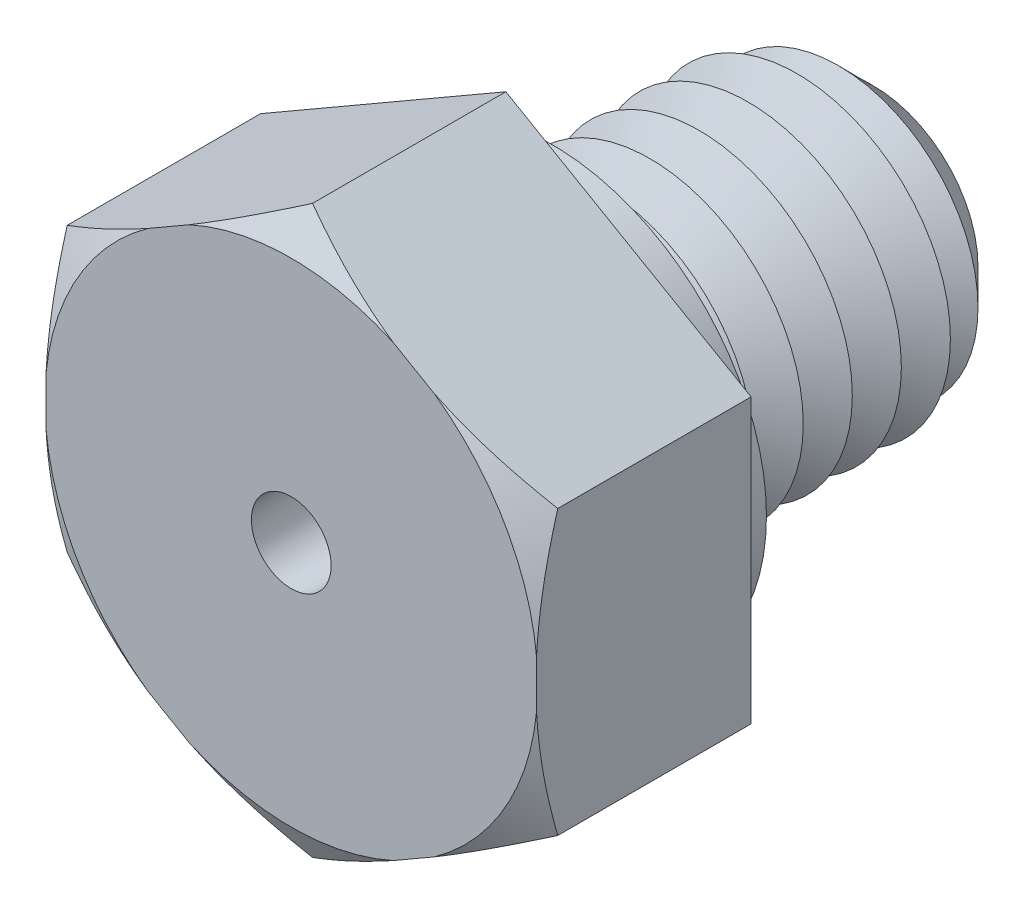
from build123d import *

# Parameters (mm, degrees)
BOSS_EXTRUDE1_DEPTH = 3.5
SKETCH3_R           = 2.5
BOSS_EXTRUDE2_DEPTH = 6
SKETCH4_R           = 3.5
BOSS_EXTRUDE3_DEPTH = 0.75
CHAMFER1_SIZE       = 0.8
LPATTERN1_COUNT     = 6
LPATTERN1_PITCH     = 0.8
SKETCH8_R           = 0.65
CUT_EXTRUDE1_DEPTH  = 9.5


with BuildPart() as part:
    # Sketch2 → Boss-Extrude1 (new body)
    with BuildSketch(Plane.XY):
        Polygon((0, 4.618802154), (-4, 2.309401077), (-4, -2.309401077), (0, -4.618802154), (4, -2.309401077), (4, 2.309401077), align=None)
    extrude(amount=BOSS_EXTRUDE1_DEPTH)

    # Sketch3 → Boss-Extrude2 (add)
    with BuildSketch(Plane(origin=(0, 0, 0), x_dir=(-1, 0, 0), z_dir=(0, 0, -1))):
        Circle(SKETCH3_R)
    extrude(amount=BOSS_EXTRUDE2_DEPTH)

    # Sketch4 → Boss-Extrude3 (add)
    with BuildSketch(Plane(origin=(0, 0, 0), x_dir=(-1, 0, 0), z_dir=(0, 0, -1))):
        with Locations(Location((0, 0, 0), (0, 0, 180))):
            Circle(SKETCH4_R)
    extrude(amount=BOSS_EXTRUDE3_DEPTH)

    # Chamfer1
    chamfer1_edges = [part.edges().sort_by_distance(p)[0] for p in [
        (2.5, 0, -6),
    ]]
    chamfer(chamfer1_edges, length=CHAMFER1_SIZE)

    # Sketch6 → Cut-Revolve1 (revolve, cut)
    with BuildSketch(Plane(origin=(0, 0, 0), x_dir=(0, 0, -1), z_dir=(1, 0, 0)), mode=Mode.PRIVATE) as cut_revolve1_sk:
        Polygon((0.75, 2.5), (1.15, 1.807179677), (1.55, 2.5), align=None)
    cut_revolve1 = revolve(cut_revolve1_sk.sketch.rotate(Axis((0, 0, 3.211670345), (0, 0, -1)), 90), axis=Axis((0, 0, 3.211670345), (0, 0, -1)), mode=Mode.SUBTRACT)

    # LPattern1: Cut-Revolve1 ×6
    with Locations(*[(0, 0, -i * LPATTERN1_PITCH) for i in range(1, LPATTERN1_COUNT)]):
        add(cut_revolve1, mode=Mode.SUBTRACT)

    # Sketch7 → Cut-Revolve2 (revolve, cut)
    with BuildSketch(Plane(origin=(0, 0, 0), x_dir=(0, 0, -1), z_dir=(1, 0, 0)), mode=Mode.PRIVATE) as cut_revolve2_sk:
        Polygon((-3.5, 4.618802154), (-3.5, 4.018802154), (-3.153589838, 4.618802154), align=None)
    revolve(cut_revolve2_sk.sketch.rotate(Axis((0, 0, 3.211670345), (0, 0, -1)), 90), axis=Axis((0, 0, 3.211670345), (0, 0, -1)), mode=Mode.SUBTRACT)

    # Sketch8 → Cut-Extrude1 (cut)
    with BuildSketch(Plane.XY.offset(3.5)):
        Circle(SKETCH8_R)
    extrude(amount=-CUT_EXTRUDE1_DEPTH, mode=Mode.SUBTRACT)


solid = part.part
